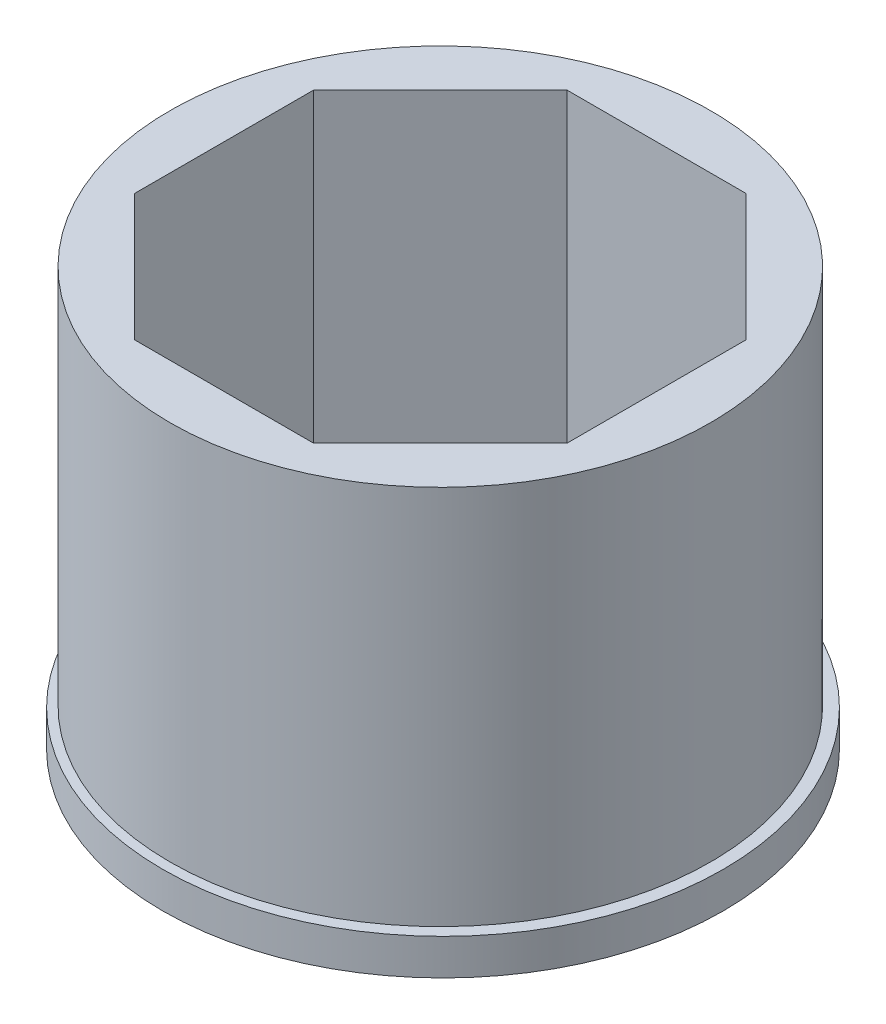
from build123d import *

# Parameters (mm, degrees)
SKETCH1_R               = 6.75
BOSS_EXTRUDE1_DEPTH     = 9.5
SKETCH3_R               = 7
BOSS_EXTRUDE2_DEPTH     = 0.9
CUT_EXTRUDE1_DEPTH      = 15
CUT_EXTRUDE1_DEPTH_BACK = 15


with BuildPart() as part:
    # Sketch1 → Boss-Extrude1 (new body)
    with BuildSketch(Plane(origin=(0, 0, 0), x_dir=(1, 0, 0), z_dir=(0, 1, 0))):
        with Locations(Location((0, 0, 0), (0, 0, 270))):
            Circle(SKETCH1_R)
    extrude(amount=BOSS_EXTRUDE1_DEPTH)

    # Sketch3 → Boss-Extrude2 (add)
    with BuildSketch(Plane(origin=(0, 0, 0), x_dir=(1, 0, 0), z_dir=(0, 1, 0))):
        with Locations(Location((0.067432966, 0, 0), (0, 0, 270))):
            Circle(SKETCH3_R)
    extrude(amount=-BOSS_EXTRUDE2_DEPTH)

    # Sketch2 → Cut-Extrude1 (cut, two sides: drawn at the far end of the back side and taken through both)
    with BuildSketch(Plane.XZ.offset(-CUT_EXTRUDE1_DEPTH_BACK)):
        Polygon((5.4, 2.236753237), (2.236753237, 5.4), (-2.236753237, 5.4), (-5.4, 2.236753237), (-5.4, -2.236753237), (-2.236753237, -5.4), (2.236753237, -5.4), (5.4, -2.236753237), align=None)
    extrude(amount=CUT_EXTRUDE1_DEPTH + CUT_EXTRUDE1_DEPTH_BACK, mode=Mode.SUBTRACT)


solid = part.part
